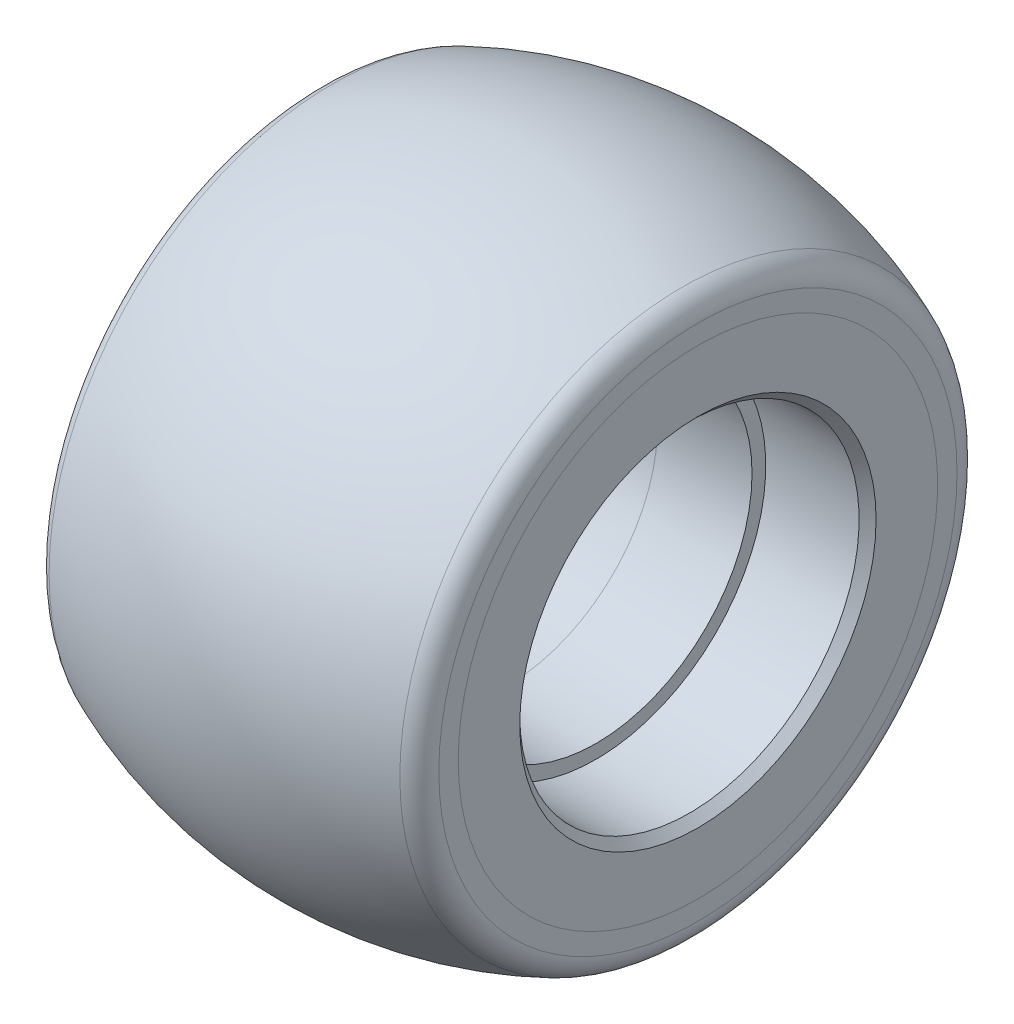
ISO-10303-21;
HEADER;
FILE_DESCRIPTION(('STEP AP214'),'2;1');
FILE_NAME('part.step','',(''),(''),'','','');
FILE_SCHEMA(('AUTOMOTIVE_DESIGN { 1 0 10303 214 1 1 1 1 }'));
ENDSEC;
DATA;
#1=APPLICATION_CONTEXT('core data for automotive mechanical design processes');
#2=APPLICATION_PROTOCOL_DEFINITION('international standard','automotive_design',2000,#1);
#3=PRODUCT_CONTEXT('',#1,'mechanical');
#4=PRODUCT('Part','Part','',(#3));
#5=PRODUCT_RELATED_PRODUCT_CATEGORY('part','',(#4));
#6=PRODUCT_DEFINITION_FORMATION('','',#4);
#7=PRODUCT_DEFINITION_CONTEXT('part definition',#1,'design');
#8=PRODUCT_DEFINITION('design','',#6,#7);
#9=PRODUCT_DEFINITION_SHAPE('','',#8);
#10=(LENGTH_UNIT() NAMED_UNIT(*) SI_UNIT(.MILLI.,.METRE.));
#11=(NAMED_UNIT(*) PLANE_ANGLE_UNIT() SI_UNIT($,.RADIAN.));
#12=(NAMED_UNIT(*) SI_UNIT($,.STERADIAN.) SOLID_ANGLE_UNIT());
#13=UNCERTAINTY_MEASURE_WITH_UNIT(LENGTH_MEASURE(1.E-05),#10,'distance_accuracy_value','');
#14=(GEOMETRIC_REPRESENTATION_CONTEXT(3) GLOBAL_UNCERTAINTY_ASSIGNED_CONTEXT((#13)) GLOBAL_UNIT_ASSIGNED_CONTEXT((#10,
#11,#12)) REPRESENTATION_CONTEXT('',''));
#15=CARTESIAN_POINT('',(0.,0.,0.));
#16=DIRECTION('',(0.,0.,1.));
#17=DIRECTION('',(1.,0.,0.));
#18=AXIS2_PLACEMENT_3D('',#15,#16,#17);
#19=CARTESIAN_POINT('',(0.,0.,0.));
#20=DIRECTION('',(-1.,0.,0.));
#21=DIRECTION('',(0.,0.,1.));
#22=AXIS2_PLACEMENT_3D('',#19,#20,#21);
#23=CONICAL_SURFACE('',#22,29.5,0.055498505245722);
#24=CARTESIAN_POINT('',(22.5,0.,0.));
#25=DIRECTION('',(-1.,0.,0.));
#26=DIRECTION('',(0.,0.,1.));
#27=AXIS2_PLACEMENT_3D('',#24,#25,#26);
#28=CIRCLE('',#27,28.2499999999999);
#29=CARTESIAN_POINT('',(22.5,0.,28.2499999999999));
#30=VERTEX_POINT('',#29);
#31=EDGE_CURVE('E11',#30,#30,#28,.T.);
#32=ORIENTED_EDGE('',*,*,#31,.F.);
#33=EDGE_LOOP('',(#32));
#34=FACE_BOUND('',#33,.T.);
#35=CARTESIAN_POINT('',(0.,0.,0.));
#36=DIRECTION('',(-1.,0.,0.));
#37=DIRECTION('',(0.,0.,1.));
#38=AXIS2_PLACEMENT_3D('',#35,#36,#37);
#39=CIRCLE('',#38,29.5);
#40=CARTESIAN_POINT('',(0.,0.,29.5));
#41=VERTEX_POINT('',#40);
#42=EDGE_CURVE('E70',#41,#41,#39,.T.);
#43=ORIENTED_EDGE('',*,*,#42,.T.);
#44=EDGE_LOOP('',(#43));
#45=FACE_BOUND('',#44,.T.);
#46=ADVANCED_FACE('F45',(#34,#45),#23,.F.);
#47=CARTESIAN_POINT('',(22.5,0.,-28.2499999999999));
#48=DIRECTION('',(-1.,0.,0.));
#49=DIRECTION('',(0.,0.,1.));
#50=AXIS2_PLACEMENT_3D('',#47,#48,#49);
#51=PLANE('',#50);
#52=CARTESIAN_POINT('',(22.5,0.,0.));
#53=DIRECTION('',(-1.,0.,0.));
#54=DIRECTION('',(0.,0.,1.));
#55=AXIS2_PLACEMENT_3D('',#52,#53,#54);
#56=CIRCLE('',#55,30.5407428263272);
#57=CARTESIAN_POINT('',(22.5,0.,30.5407428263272));
#58=VERTEX_POINT('',#57);
#59=EDGE_CURVE('E51',#58,#58,#56,.T.);
#60=ORIENTED_EDGE('',*,*,#59,.F.);
#61=EDGE_LOOP('',(#60));
#62=FACE_BOUND('',#61,.T.);
#63=ORIENTED_EDGE('',*,*,#31,.T.);
#64=EDGE_LOOP('',(#63));
#65=FACE_BOUND('',#64,.T.);
#66=ADVANCED_FACE('F101',(#62,#65),#51,.F.);
#67=CARTESIAN_POINT('',(19.5,0.,0.));
#68=DIRECTION('',(-1.,0.,0.));
#69=DIRECTION('',(0.,0.,1.));
#70=AXIS2_PLACEMENT_3D('',#67,#68,#69);
#71=TOROIDAL_SURFACE('',#70,30.5407428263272,3.);
#72=CARTESIAN_POINT('',(20.6699999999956,0.,0.));
#73=DIRECTION('',(-1.,0.,0.));
#74=DIRECTION('',(0.,0.,1.));
#75=AXIS2_PLACEMENT_3D('',#72,#73,#74);
#76=CIRCLE('',#75,33.3031873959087);
#77=CARTESIAN_POINT('',(20.6699999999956,0.,33.3031873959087));
#78=VERTEX_POINT('',#77);
#79=EDGE_CURVE('E55',#78,#78,#76,.T.);
#80=ORIENTED_EDGE('',*,*,#79,.F.);
#81=EDGE_LOOP('',(#80));
#82=FACE_BOUND('',#81,.T.);
#83=ORIENTED_EDGE('',*,*,#59,.T.);
#84=EDGE_LOOP('',(#83));
#85=FACE_BOUND('',#84,.T.);
#86=ADVANCED_FACE('F96',(#82,#85),#71,.T.);
#87=CARTESIAN_POINT('',(0.,0.,0.));
#88=DIRECTION('',(-1.,0.,0.));
#89=DIRECTION('',(0.,0.,1.));
#90=AXIS2_PLACEMENT_3D('',#87,#88,#89);
#91=DEGENERATE_TOROIDAL_SURFACE('',#90,15.5,53.,.F.);
#92=CARTESIAN_POINT('',(-20.6699999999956,0.,0.));
#93=DIRECTION('',(-1.,0.,0.));
#94=DIRECTION('',(0.,0.,1.));
#95=AXIS2_PLACEMENT_3D('',#92,#93,#94);
#96=CIRCLE('',#95,33.3031873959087);
#97=CARTESIAN_POINT('',(-20.6699999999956,0.,33.3031873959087));
#98=VERTEX_POINT('',#97);
#99=EDGE_CURVE('E59',#98,#98,#96,.T.);
#100=ORIENTED_EDGE('',*,*,#99,.F.);
#101=EDGE_LOOP('',(#100));
#102=FACE_BOUND('',#101,.T.);
#103=ORIENTED_EDGE('',*,*,#79,.T.);
#104=EDGE_LOOP('',(#103));
#105=FACE_BOUND('',#104,.T.);
#106=ADVANCED_FACE('F90',(#102,#105),#91,.F.);
#107=CARTESIAN_POINT('',(-19.5,0.,0.));
#108=DIRECTION('',(-1.,0.,0.));
#109=DIRECTION('',(0.,0.,1.));
#110=AXIS2_PLACEMENT_3D('',#107,#108,#109);
#111=TOROIDAL_SURFACE('',#110,30.5407428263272,3.);
#112=CARTESIAN_POINT('',(-22.5,0.,0.));
#113=DIRECTION('',(-1.,0.,0.));
#114=DIRECTION('',(0.,0.,1.));
#115=AXIS2_PLACEMENT_3D('',#112,#113,#114);
#116=CIRCLE('',#115,30.5407428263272);
#117=CARTESIAN_POINT('',(-22.5,0.,30.5407428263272));
#118=VERTEX_POINT('',#117);
#119=EDGE_CURVE('E64',#118,#118,#116,.T.);
#120=ORIENTED_EDGE('',*,*,#119,.F.);
#121=EDGE_LOOP('',(#120));
#122=FACE_BOUND('',#121,.T.);
#123=ORIENTED_EDGE('',*,*,#99,.T.);
#124=EDGE_LOOP('',(#123));
#125=FACE_BOUND('',#124,.T.);
#126=ADVANCED_FACE('F84',(#122,#125),#111,.T.);
#127=CARTESIAN_POINT('',(-22.5,0.,-28.2499999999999));
#128=DIRECTION('',(1.,0.,0.));
#129=DIRECTION('',(0.,0.,-1.));
#130=AXIS2_PLACEMENT_3D('',#127,#128,#129);
#131=PLANE('',#130);
#132=CARTESIAN_POINT('',(-22.5,0.,0.));
#133=DIRECTION('',(-1.,0.,0.));
#134=DIRECTION('',(0.,0.,1.));
#135=AXIS2_PLACEMENT_3D('',#132,#133,#134);
#136=CIRCLE('',#135,28.2499999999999);
#137=CARTESIAN_POINT('',(-22.5,0.,28.2499999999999));
#138=VERTEX_POINT('',#137);
#139=EDGE_CURVE('E67',#138,#138,#136,.T.);
#140=ORIENTED_EDGE('',*,*,#139,.F.);
#141=EDGE_LOOP('',(#140));
#142=FACE_BOUND('',#141,.T.);
#143=ORIENTED_EDGE('',*,*,#119,.T.);
#144=EDGE_LOOP('',(#143));
#145=FACE_BOUND('',#144,.T.);
#146=ADVANCED_FACE('F78',(#142,#145),#131,.F.);
#147=CARTESIAN_POINT('',(-22.5,0.,0.));
#148=DIRECTION('',(1.,0.,0.));
#149=DIRECTION('',(0.,0.,-1.));
#150=AXIS2_PLACEMENT_3D('',#147,#148,#149);
#151=CONICAL_SURFACE('',#150,28.2499999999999,0.055498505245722);
#152=ORIENTED_EDGE('',*,*,#42,.F.);
#153=EDGE_LOOP('',(#152));
#154=FACE_BOUND('',#153,.T.);
#155=ORIENTED_EDGE('',*,*,#139,.T.);
#156=EDGE_LOOP('',(#155));
#157=FACE_BOUND('',#156,.T.);
#158=ADVANCED_FACE('F75',(#154,#157),#151,.F.);
#159=CLOSED_SHELL('',(#46,#66,#86,#106,#126,#146,#158));
#160=MANIFOLD_SOLID_BREP('B2',#159);
#161=CARTESIAN_POINT('',(22.5,0.,-21.));
#162=DIRECTION('',(-1.,0.,0.));
#163=DIRECTION('',(0.,0.,1.));
#164=AXIS2_PLACEMENT_3D('',#161,#162,#163);
#165=PLANE('',#164);
#166=CARTESIAN_POINT('',(22.5,0.,0.));
#167=DIRECTION('',(-1.,0.,0.));
#168=DIRECTION('',(0.,0.,1.));
#169=AXIS2_PLACEMENT_3D('',#166,#167,#168);
#170=CIRCLE('',#169,28.2499999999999);
#171=CARTESIAN_POINT('',(22.5,0.,28.2499999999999));
#172=VERTEX_POINT('',#171);
#173=EDGE_CURVE('E192',#172,#172,#170,.T.);
#174=ORIENTED_EDGE('',*,*,#173,.F.);
#175=EDGE_LOOP('',(#174));
#176=FACE_BOUND('',#175,.T.);
#177=CARTESIAN_POINT('',(22.5,0.,0.));
#178=DIRECTION('',(-1.,0.,0.));
#179=DIRECTION('',(0.,0.,1.));
#180=AXIS2_PLACEMENT_3D('',#177,#178,#179);
#181=CIRCLE('',#180,21.);
#182=CARTESIAN_POINT('',(22.5,0.,21.));
#183=VERTEX_POINT('',#182);
#184=EDGE_CURVE('E44',#183,#183,#181,.T.);
#185=ORIENTED_EDGE('',*,*,#184,.T.);
#186=EDGE_LOOP('',(#185));
#187=FACE_BOUND('',#186,.T.);
#188=ADVANCED_FACE('F152',(#176,#187),#165,.F.);
#189=CARTESIAN_POINT('',(21.5,0.,0.));
#190=DIRECTION('',(1.,0.,0.));
#191=DIRECTION('',(0.,0.,-1.));
#192=AXIS2_PLACEMENT_3D('',#189,#190,#191);
#193=CONICAL_SURFACE('',#192,20.,0.785398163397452);
#194=ORIENTED_EDGE('',*,*,#184,.F.);
#195=EDGE_LOOP('',(#194));
#196=FACE_BOUND('',#195,.T.);
#197=CARTESIAN_POINT('',(21.5,0.,0.));
#198=DIRECTION('',(-1.,0.,0.));
#199=DIRECTION('',(0.,0.,1.));
#200=AXIS2_PLACEMENT_3D('',#197,#198,#199);
#201=CIRCLE('',#200,20.);
#202=CARTESIAN_POINT('',(21.5,0.,20.));
#203=VERTEX_POINT('',#202);
#204=EDGE_CURVE('E158',#203,#203,#201,.T.);
#205=ORIENTED_EDGE('',*,*,#204,.T.);
#206=EDGE_LOOP('',(#205));
#207=FACE_BOUND('',#206,.T.);
#208=ADVANCED_FACE('F199',(#196,#207),#193,.F.);
#209=CARTESIAN_POINT('',(-26.3062155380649,0.,0.));
#210=DIRECTION('',(-1.,0.,0.));
#211=DIRECTION('',(0.,0.,1.));
#212=AXIS2_PLACEMENT_3D('',#209,#210,#211);
#213=CYLINDRICAL_SURFACE('',#212,20.);
#214=ORIENTED_EDGE('',*,*,#204,.F.);
#215=EDGE_LOOP('',(#214));
#216=FACE_BOUND('',#215,.T.);
#217=CARTESIAN_POINT('',(10.5,0.,0.));
#218=DIRECTION('',(-1.,0.,0.));
#219=DIRECTION('',(0.,0.,1.));
#220=AXIS2_PLACEMENT_3D('',#217,#218,#219);
#221=CIRCLE('',#220,20.);
#222=CARTESIAN_POINT('',(10.5,0.,20.));
#223=VERTEX_POINT('',#222);
#224=EDGE_CURVE('E162',#223,#223,#221,.T.);
#225=ORIENTED_EDGE('',*,*,#224,.T.);
#226=EDGE_LOOP('',(#225));
#227=FACE_BOUND('',#226,.T.);
#228=ADVANCED_FACE('F203',(#216,#227),#213,.F.);
#229=CARTESIAN_POINT('',(10.5,0.,-18.3800000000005));
#230=DIRECTION('',(-1.,0.,0.));
#231=DIRECTION('',(0.,0.,1.));
#232=AXIS2_PLACEMENT_3D('',#229,#230,#231);
#233=PLANE('',#232);
#234=ORIENTED_EDGE('',*,*,#224,.F.);
#235=EDGE_LOOP('',(#234));
#236=FACE_BOUND('',#235,.T.);
#237=CARTESIAN_POINT('',(10.5,0.,0.));
#238=DIRECTION('',(-1.,0.,0.));
#239=DIRECTION('',(0.,0.,1.));
#240=AXIS2_PLACEMENT_3D('',#237,#238,#239);
#241=CIRCLE('',#240,18.3800000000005);
#242=CARTESIAN_POINT('',(10.5,0.,18.3800000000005));
#243=VERTEX_POINT('',#242);
#244=EDGE_CURVE('E166',#243,#243,#241,.T.);
#245=ORIENTED_EDGE('',*,*,#244,.T.);
#246=EDGE_LOOP('',(#245));
#247=FACE_BOUND('',#246,.T.);
#248=ADVANCED_FACE('F208',(#236,#247),#233,.F.);
#249=CARTESIAN_POINT('',(0.,0.,0.));
#250=DIRECTION('',(1.,0.,0.));
#251=DIRECTION('',(0.,0.,-1.));
#252=AXIS2_PLACEMENT_3D('',#249,#250,#251);
#253=CONICAL_SURFACE('',#252,17.75,0.0599281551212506);
#254=ORIENTED_EDGE('',*,*,#244,.F.);
#255=EDGE_LOOP('',(#254));
#256=FACE_BOUND('',#255,.T.);
#257=CARTESIAN_POINT('',(0.,0.,0.));
#258=DIRECTION('',(-1.,0.,0.));
#259=DIRECTION('',(0.,0.,1.));
#260=AXIS2_PLACEMENT_3D('',#257,#258,#259);
#261=CIRCLE('',#260,17.75);
#262=CARTESIAN_POINT('',(0.,0.,17.75));
#263=VERTEX_POINT('',#262);
#264=EDGE_CURVE('E171',#263,#263,#261,.T.);
#265=ORIENTED_EDGE('',*,*,#264,.T.);
#266=EDGE_LOOP('',(#265));
#267=FACE_BOUND('',#266,.T.);
#268=ADVANCED_FACE('F214',(#256,#267),#253,.F.);
#269=CARTESIAN_POINT('',(-10.4999999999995,0.,0.));
#270=DIRECTION('',(-1.,0.,0.));
#271=DIRECTION('',(0.,0.,1.));
#272=AXIS2_PLACEMENT_3D('',#269,#270,#271);
#273=CONICAL_SURFACE('',#272,18.3800000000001,0.0599281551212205);
#274=ORIENTED_EDGE('',*,*,#264,.F.);
#275=EDGE_LOOP('',(#274));
#276=FACE_BOUND('',#275,.T.);
#277=CARTESIAN_POINT('',(-10.4999999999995,0.,0.));
#278=DIRECTION('',(-1.,0.,0.));
#279=DIRECTION('',(0.,0.,1.));
#280=AXIS2_PLACEMENT_3D('',#277,#278,#279);
#281=CIRCLE('',#280,18.3800000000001);
#282=CARTESIAN_POINT('',(-10.4999999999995,0.,18.3800000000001));
#283=VERTEX_POINT('',#282);
#284=EDGE_CURVE('E174',#283,#283,#281,.T.);
#285=ORIENTED_EDGE('',*,*,#284,.T.);
#286=EDGE_LOOP('',(#285));
#287=FACE_BOUND('',#286,.T.);
#288=ADVANCED_FACE('F218',(#276,#287),#273,.F.);
#289=CARTESIAN_POINT('',(-10.4999999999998,0.,-20.));
#290=DIRECTION('',(1.,0.,0.));
#291=DIRECTION('',(0.,0.,-1.));
#292=AXIS2_PLACEMENT_3D('',#289,#290,#291);
#293=PLANE('',#292);
#294=ORIENTED_EDGE('',*,*,#284,.F.);
#295=EDGE_LOOP('',(#294));
#296=FACE_BOUND('',#295,.T.);
#297=CARTESIAN_POINT('',(-10.5,0.,0.));
#298=DIRECTION('',(-1.,0.,0.));
#299=DIRECTION('',(0.,0.,1.));
#300=AXIS2_PLACEMENT_3D('',#297,#298,#299);
#301=CIRCLE('',#300,20.);
#302=CARTESIAN_POINT('',(-10.5,0.,20.));
#303=VERTEX_POINT('',#302);
#304=EDGE_CURVE('E177',#303,#303,#301,.T.);
#305=ORIENTED_EDGE('',*,*,#304,.T.);
#306=EDGE_LOOP('',(#305));
#307=FACE_BOUND('',#306,.T.);
#308=ADVANCED_FACE('F222',(#296,#307),#293,.F.);
#309=CARTESIAN_POINT('',(-26.3062155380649,0.,0.));
#310=DIRECTION('',(-1.,0.,0.));
#311=DIRECTION('',(0.,0.,1.));
#312=AXIS2_PLACEMENT_3D('',#309,#310,#311);
#313=CYLINDRICAL_SURFACE('',#312,20.);
#314=ORIENTED_EDGE('',*,*,#304,.F.);
#315=EDGE_LOOP('',(#314));
#316=FACE_BOUND('',#315,.T.);
#317=CARTESIAN_POINT('',(-21.5,0.,0.));
#318=DIRECTION('',(-1.,0.,0.));
#319=DIRECTION('',(0.,0.,1.));
#320=AXIS2_PLACEMENT_3D('',#317,#318,#319);
#321=CIRCLE('',#320,20.);
#322=CARTESIAN_POINT('',(-21.5,0.,20.));
#323=VERTEX_POINT('',#322);
#324=EDGE_CURVE('E180',#323,#323,#321,.T.);
#325=ORIENTED_EDGE('',*,*,#324,.T.);
#326=EDGE_LOOP('',(#325));
#327=FACE_BOUND('',#326,.T.);
#328=ADVANCED_FACE('F226',(#316,#327),#313,.F.);
#329=CARTESIAN_POINT('',(-22.5,0.,0.));
#330=DIRECTION('',(-1.,0.,0.));
#331=DIRECTION('',(0.,0.,1.));
#332=AXIS2_PLACEMENT_3D('',#329,#330,#331);
#333=CONICAL_SURFACE('',#332,20.9999999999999,0.785398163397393);
#334=ORIENTED_EDGE('',*,*,#324,.F.);
#335=EDGE_LOOP('',(#334));
#336=FACE_BOUND('',#335,.T.);
#337=CARTESIAN_POINT('',(-22.5,0.,0.));
#338=DIRECTION('',(-1.,0.,0.));
#339=DIRECTION('',(0.,0.,1.));
#340=AXIS2_PLACEMENT_3D('',#337,#338,#339);
#341=CIRCLE('',#340,20.9999999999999);
#342=CARTESIAN_POINT('',(-22.5,0.,20.9999999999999));
#343=VERTEX_POINT('',#342);
#344=EDGE_CURVE('E183',#343,#343,#341,.T.);
#345=ORIENTED_EDGE('',*,*,#344,.T.);
#346=EDGE_LOOP('',(#345));
#347=FACE_BOUND('',#346,.T.);
#348=ADVANCED_FACE('F230',(#336,#347),#333,.F.);
#349=CARTESIAN_POINT('',(-22.5,0.,-28.2499999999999));
#350=DIRECTION('',(1.,0.,0.));
#351=DIRECTION('',(0.,0.,-1.));
#352=AXIS2_PLACEMENT_3D('',#349,#350,#351);
#353=PLANE('',#352);
#354=ORIENTED_EDGE('',*,*,#344,.F.);
#355=EDGE_LOOP('',(#354));
#356=FACE_BOUND('',#355,.T.);
#357=CARTESIAN_POINT('',(-22.5,0.,0.));
#358=DIRECTION('',(-1.,0.,0.));
#359=DIRECTION('',(0.,0.,1.));
#360=AXIS2_PLACEMENT_3D('',#357,#358,#359);
#361=CIRCLE('',#360,28.2499999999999);
#362=CARTESIAN_POINT('',(-22.5,0.,28.2499999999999));
#363=VERTEX_POINT('',#362);
#364=EDGE_CURVE('E186',#363,#363,#361,.T.);
#365=ORIENTED_EDGE('',*,*,#364,.T.);
#366=EDGE_LOOP('',(#365));
#367=FACE_BOUND('',#366,.T.);
#368=ADVANCED_FACE('F234',(#356,#367),#353,.F.);
#369=CARTESIAN_POINT('',(0.,0.,0.));
#370=DIRECTION('',(1.,0.,0.));
#371=DIRECTION('',(0.,0.,-1.));
#372=AXIS2_PLACEMENT_3D('',#369,#370,#371);
#373=CONICAL_SURFACE('',#372,29.5,0.055498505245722);
#374=ORIENTED_EDGE('',*,*,#364,.F.);
#375=EDGE_LOOP('',(#374));
#376=FACE_BOUND('',#375,.T.);
#377=CARTESIAN_POINT('',(0.,0.,0.));
#378=DIRECTION('',(-1.,0.,0.));
#379=DIRECTION('',(0.,0.,1.));
#380=AXIS2_PLACEMENT_3D('',#377,#378,#379);
#381=CIRCLE('',#380,29.5);
#382=CARTESIAN_POINT('',(0.,0.,29.5));
#383=VERTEX_POINT('',#382);
#384=EDGE_CURVE('E189',#383,#383,#381,.T.);
#385=ORIENTED_EDGE('',*,*,#384,.T.);
#386=EDGE_LOOP('',(#385));
#387=FACE_BOUND('',#386,.T.);
#388=ADVANCED_FACE('F238',(#376,#387),#373,.T.);
#389=CARTESIAN_POINT('',(22.5,0.,0.));
#390=DIRECTION('',(-1.,0.,0.));
#391=DIRECTION('',(0.,0.,1.));
#392=AXIS2_PLACEMENT_3D('',#389,#390,#391);
#393=CONICAL_SURFACE('',#392,28.2499999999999,0.055498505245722);
#394=ORIENTED_EDGE('',*,*,#384,.F.);
#395=EDGE_LOOP('',(#394));
#396=FACE_BOUND('',#395,.T.);
#397=ORIENTED_EDGE('',*,*,#173,.T.);
#398=EDGE_LOOP('',(#397));
#399=FACE_BOUND('',#398,.T.);
#400=ADVANCED_FACE('F196',(#396,#399),#393,.T.);
#401=CLOSED_SHELL('',(#188,#208,#228,#248,#268,#288,#308,#328,#348,#368,#388,#400));
#402=MANIFOLD_SOLID_BREP('B6',#401);
#403=ADVANCED_BREP_SHAPE_REPRESENTATION('',(#18,#160,#402),#14);
#404=SHAPE_DEFINITION_REPRESENTATION(#9,#403);
ENDSEC;
END-ISO-10303-21;
